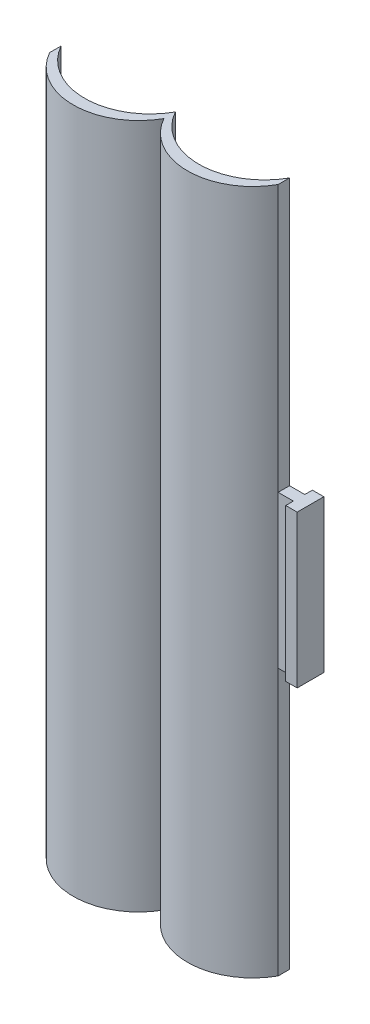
from build123d import *

# Parameters (mm, degrees)
BOSS_EXTRUDE1_DEPTH = 180
BOSS_EXTRUDE2_DEPTH = 20


with BuildPart() as part:
    # Sketch1 → Boss-Extrude1 (new body)
    with BuildSketch(Plane(origin=(0, 0, 0), x_dir=(1, 0, 0), z_dir=(0, 1, 0))):
        with BuildLine():
            Line((0, 0), (0, -3))
            ThreePointArc((0, -3), (-15, -11.80567079), (-30, -3))
            ThreePointArc((-30, -3), (-45, -11.80567079), (-60, -3))
            Line((-60, -3), (-60, 0))
            ThreePointArc((-60, 0), (-45, -8.80567079), (-30, 0))
            ThreePointArc((-30, 0), (-15, -8.80567079), (0, 0))
        make_face()
    extrude(amount=BOSS_EXTRUDE1_DEPTH)

    # Sketch3 → Boss-Extrude2 (add, symmetric)
    with BuildSketch(Plane(origin=(0, 90, 0), x_dir=(1, 0, 0), z_dir=(0, 1, 0))):
        Polygon((4, -3), (4, -5), (7, -5), (7, 2), (4, 2), (4, 0), (0, 0), (0, -3), align=None)
    extrude(amount=BOSS_EXTRUDE2_DEPTH, both=True)


solid = part.part
